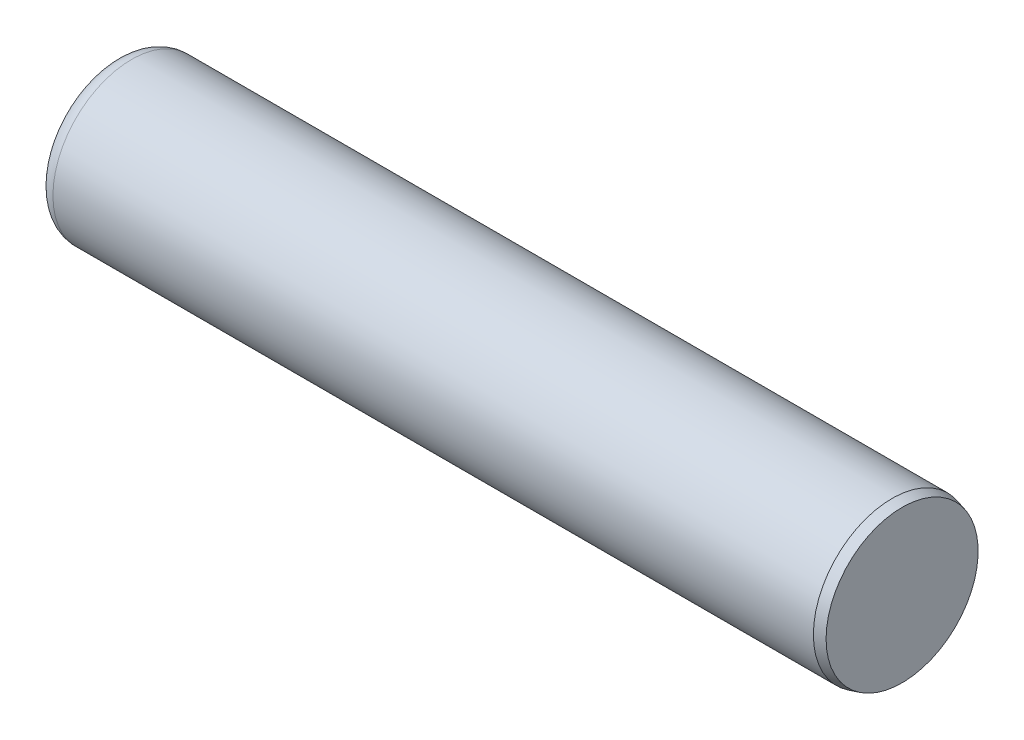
ISO-10303-21;
HEADER;
FILE_DESCRIPTION(('STEP AP214'),'2;1');
FILE_NAME('part.step','',(''),(''),'','','');
FILE_SCHEMA(('AUTOMOTIVE_DESIGN { 1 0 10303 214 1 1 1 1 }'));
ENDSEC;
DATA;
#1=APPLICATION_CONTEXT('core data for automotive mechanical design processes');
#2=APPLICATION_PROTOCOL_DEFINITION('international standard','automotive_design',2000,#1);
#3=PRODUCT_CONTEXT('',#1,'mechanical');
#4=PRODUCT('Part','Part','',(#3));
#5=PRODUCT_RELATED_PRODUCT_CATEGORY('part','',(#4));
#6=PRODUCT_DEFINITION_FORMATION('','',#4);
#7=PRODUCT_DEFINITION_CONTEXT('part definition',#1,'design');
#8=PRODUCT_DEFINITION('design','',#6,#7);
#9=PRODUCT_DEFINITION_SHAPE('','',#8);
#10=(LENGTH_UNIT() NAMED_UNIT(*) SI_UNIT(.MILLI.,.METRE.));
#11=(NAMED_UNIT(*) PLANE_ANGLE_UNIT() SI_UNIT($,.RADIAN.));
#12=(NAMED_UNIT(*) SI_UNIT($,.STERADIAN.) SOLID_ANGLE_UNIT());
#13=UNCERTAINTY_MEASURE_WITH_UNIT(LENGTH_MEASURE(1.E-05),#10,'distance_accuracy_value','');
#14=(GEOMETRIC_REPRESENTATION_CONTEXT(3) GLOBAL_UNCERTAINTY_ASSIGNED_CONTEXT((#13)) GLOBAL_UNIT_ASSIGNED_CONTEXT((#10,
#11,#12)) REPRESENTATION_CONTEXT('',''));
#15=CARTESIAN_POINT('',(0.,0.,0.));
#16=DIRECTION('',(0.,0.,1.));
#17=DIRECTION('',(1.,0.,0.));
#18=AXIS2_PLACEMENT_3D('',#15,#16,#17);
#19=CARTESIAN_POINT('',(0.,1.181484,0.));
#20=DIRECTION('',(1.,0.,0.));
#21=DIRECTION('',(0.,0.,-1.));
#22=AXIS2_PLACEMENT_3D('',#19,#20,#21);
#23=PLANE('',#22);
#24=CARTESIAN_POINT('',(0.,0.,0.));
#25=DIRECTION('',(-1.,0.,0.));
#26=DIRECTION('',(0.,0.,1.));
#27=AXIS2_PLACEMENT_3D('',#24,#25,#26);
#28=CIRCLE('',#27,1.181484);
#29=CARTESIAN_POINT('',(0.,0.,1.181484));
#30=VERTEX_POINT('',#29);
#31=EDGE_CURVE('E40',#30,#30,#28,.T.);
#32=ORIENTED_EDGE('',*,*,#31,.T.);
#33=EDGE_LOOP('',(#32));
#34=FACE_BOUND('',#33,.T.);
#35=ADVANCED_FACE('F26',(#34),#23,.F.);
#36=CARTESIAN_POINT('',(15.,0.,0.));
#37=DIRECTION('',(-1.,0.,0.));
#38=DIRECTION('',(0.,0.,1.));
#39=AXIS2_PLACEMENT_3D('',#36,#37,#38);
#40=PLANE('',#39);
#41=CARTESIAN_POINT('',(15.,0.,0.));
#42=DIRECTION('',(-1.,0.,0.));
#43=DIRECTION('',(0.,0.,1.));
#44=AXIS2_PLACEMENT_3D('',#41,#42,#43);
#45=CIRCLE('',#44,1.44879233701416);
#46=CARTESIAN_POINT('',(15.,0.,1.44879233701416));
#47=VERTEX_POINT('',#46);
#48=EDGE_CURVE('E10',#47,#47,#45,.T.);
#49=ORIENTED_EDGE('',*,*,#48,.F.);
#50=EDGE_LOOP('',(#49));
#51=FACE_BOUND('',#50,.T.);
#52=ADVANCED_FACE('F60',(#51),#40,.F.);
#53=CARTESIAN_POINT('',(15.,0.,0.));
#54=DIRECTION('',(-1.,0.,0.));
#55=DIRECTION('',(0.,0.,1.));
#56=AXIS2_PLACEMENT_3D('',#53,#54,#55);
#57=CONICAL_SURFACE('',#56,1.44879233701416,0.261799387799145);
#58=CARTESIAN_POINT('',(14.8088904,0.,0.));
#59=DIRECTION('',(-1.,0.,0.));
#60=DIRECTION('',(0.,0.,1.));
#61=AXIS2_PLACEMENT_3D('',#58,#59,#60);
#62=CIRCLE('',#61,1.5);
#63=CARTESIAN_POINT('',(14.8088904,0.,1.5));
#64=VERTEX_POINT('',#63);
#65=EDGE_CURVE('E32',#64,#64,#62,.T.);
#66=ORIENTED_EDGE('',*,*,#65,.F.);
#67=EDGE_LOOP('',(#66));
#68=FACE_BOUND('',#67,.T.);
#69=ORIENTED_EDGE('',*,*,#48,.T.);
#70=EDGE_LOOP('',(#69));
#71=FACE_BOUND('',#70,.T.);
#72=ADVANCED_FACE('F55',(#68,#71),#57,.T.);
#73=CARTESIAN_POINT('',(-6.35,0.,0.));
#74=DIRECTION('',(-1.,0.,0.));
#75=DIRECTION('',(0.,0.,1.));
#76=AXIS2_PLACEMENT_3D('',#73,#74,#75);
#77=CYLINDRICAL_SURFACE('',#76,1.5);
#78=CARTESIAN_POINT('',(0.318516,0.,0.));
#79=DIRECTION('',(-1.,0.,0.));
#80=DIRECTION('',(0.,0.,1.));
#81=AXIS2_PLACEMENT_3D('',#78,#79,#80);
#82=CIRCLE('',#81,1.5);
#83=CARTESIAN_POINT('',(0.318516,0.,1.5));
#84=VERTEX_POINT('',#83);
#85=EDGE_CURVE('E36',#84,#84,#82,.T.);
#86=ORIENTED_EDGE('',*,*,#85,.F.);
#87=EDGE_LOOP('',(#86));
#88=FACE_BOUND('',#87,.T.);
#89=ORIENTED_EDGE('',*,*,#65,.T.);
#90=EDGE_LOOP('',(#89));
#91=FACE_BOUND('',#90,.T.);
#92=ADVANCED_FACE('F50',(#88,#91),#77,.T.);
#93=CARTESIAN_POINT('',(0.318516,0.,0.));
#94=DIRECTION('',(-1.,0.,0.));
#95=DIRECTION('',(0.,0.,1.));
#96=AXIS2_PLACEMENT_3D('',#93,#94,#95);
#97=TOROIDAL_SURFACE('',#96,1.181484,0.318516);
#98=ORIENTED_EDGE('',*,*,#31,.F.);
#99=EDGE_LOOP('',(#98));
#100=FACE_BOUND('',#99,.T.);
#101=ORIENTED_EDGE('',*,*,#85,.T.);
#102=EDGE_LOOP('',(#101));
#103=FACE_BOUND('',#102,.T.);
#104=ADVANCED_FACE('F47',(#100,#103),#97,.T.);
#105=CLOSED_SHELL('',(#35,#52,#72,#92,#104));
#106=MANIFOLD_SOLID_BREP('B2',#105);
#107=ADVANCED_BREP_SHAPE_REPRESENTATION('',(#18,#106),#14);
#108=SHAPE_DEFINITION_REPRESENTATION(#9,#107);
ENDSEC;
END-ISO-10303-21;
